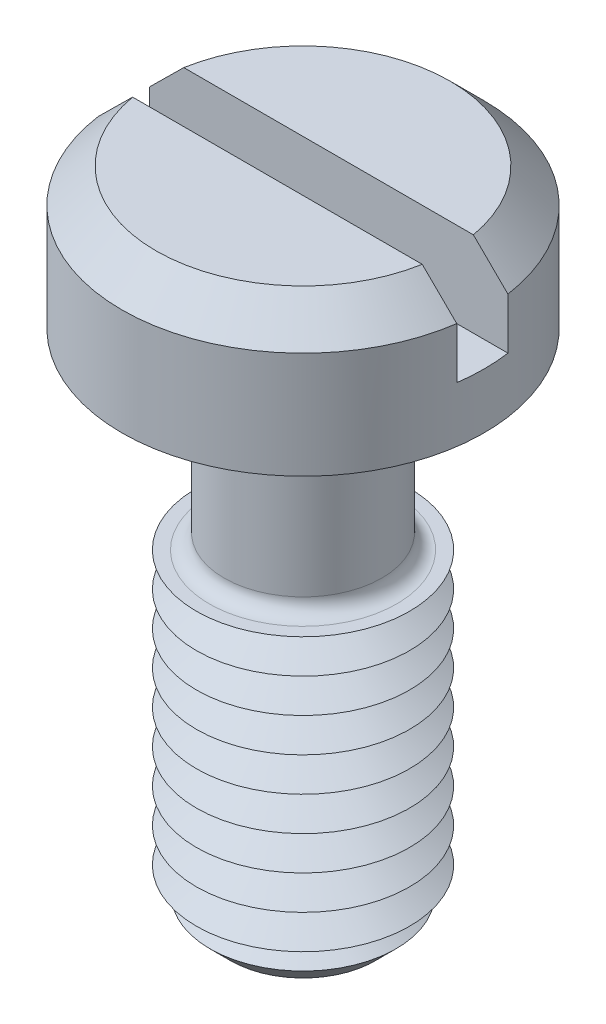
from build123d import *

# Parameters (mm, degrees)
SKETCH1_R           = 4.25
BOSS_EXTRUDE1_DEPTH = 3.3
SKETCH2_R           = 1.85
BOSS_EXTRUDE2_DEPTH = 12
SKETCH3_R           = 2.5
BOSS_EXTRUDE3_DEPTH = 7.5
CHAMFER1_SIZE       = 0.8
LPATTERN1_COUNT     = 9
LPATTERN1_PITCH     = 0.8
FILLET1_R           = 0.35
CHAMFER2_SIZE       = 0.8
SKETCH6_W           = 8.5
SKETCH6_H           = 1.2
CUT_EXTRUDE1_DEPTH  = 2


with BuildPart() as part:
    # Sketch1 → Boss-Extrude1 (new body)
    with BuildSketch(Plane(origin=(0, 0, 0), x_dir=(1, 0, 0), z_dir=(0, 1, 0))):
        with Locations(Location((0, 0, 0), (0, 0, 270))):
            Circle(SKETCH1_R)
    extrude(amount=BOSS_EXTRUDE1_DEPTH)

    # Sketch2 → Boss-Extrude2 (add)
    with BuildSketch(Plane.XZ):
        with Locations(Location((0, 0, 0), (0, 0, 270))):
            Circle(SKETCH2_R)
    extrude(amount=BOSS_EXTRUDE2_DEPTH)

    # Sketch3 → Boss-Extrude3 (add)
    with BuildSketch(Plane.XZ.offset(12)):
        with Locations(Location((0, 0, 0), (0, 0, 270))):
            Circle(SKETCH3_R)
    extrude(amount=-BOSS_EXTRUDE3_DEPTH)

    # Chamfer1
    chamfer1_edges = [part.edges().sort_by_distance(p)[0] for p in [
        (0, -12, 2.5),
    ]]
    chamfer(chamfer1_edges, length=CHAMFER1_SIZE)

    # Sketch5 → Cut-Revolve1 (revolve, cut)
    with BuildSketch(Plane(origin=(0, 0, 0), x_dir=(0, 0, -1), z_dir=(1, 0, 0))):
        Polygon((-2.5, -4.5), (-1.807179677, -4.9), (-2.5, -5.3), align=None)
    cut_revolve1 = revolve(axis=Axis((0, -6.58711856, 0), (0, -1, 0)), mode=Mode.SUBTRACT)

    # LPattern1: Cut-Revolve1 ×9
    with Locations(*[(0, -i * LPATTERN1_PITCH, 0) for i in range(1, LPATTERN1_COUNT)]):
        add(cut_revolve1, mode=Mode.SUBTRACT)

    # Fillet1
    fillet1_edges = [part.edges().sort_by_distance(p)[0] for p in [
        (0, 0, 1.85),
        (0, -4.5, 1.85),
    ]]
    fillet(fillet1_edges, radius=FILLET1_R)

    # Chamfer2
    chamfer2_edges = [part.edges().sort_by_distance(p)[0] for p in [
        (0, 3.3, -4.25),
    ]]
    chamfer(chamfer2_edges, length=CHAMFER2_SIZE)

    # Sketch6 → Cut-Extrude1 (cut)
    with BuildSketch(Plane(origin=(0, 3.3, 0), x_dir=(1, 0, 0), z_dir=(0, 1, 0))):
        Rectangle(SKETCH6_W, SKETCH6_H)
    extrude(amount=-CUT_EXTRUDE1_DEPTH, mode=Mode.SUBTRACT)


solid = part.part
